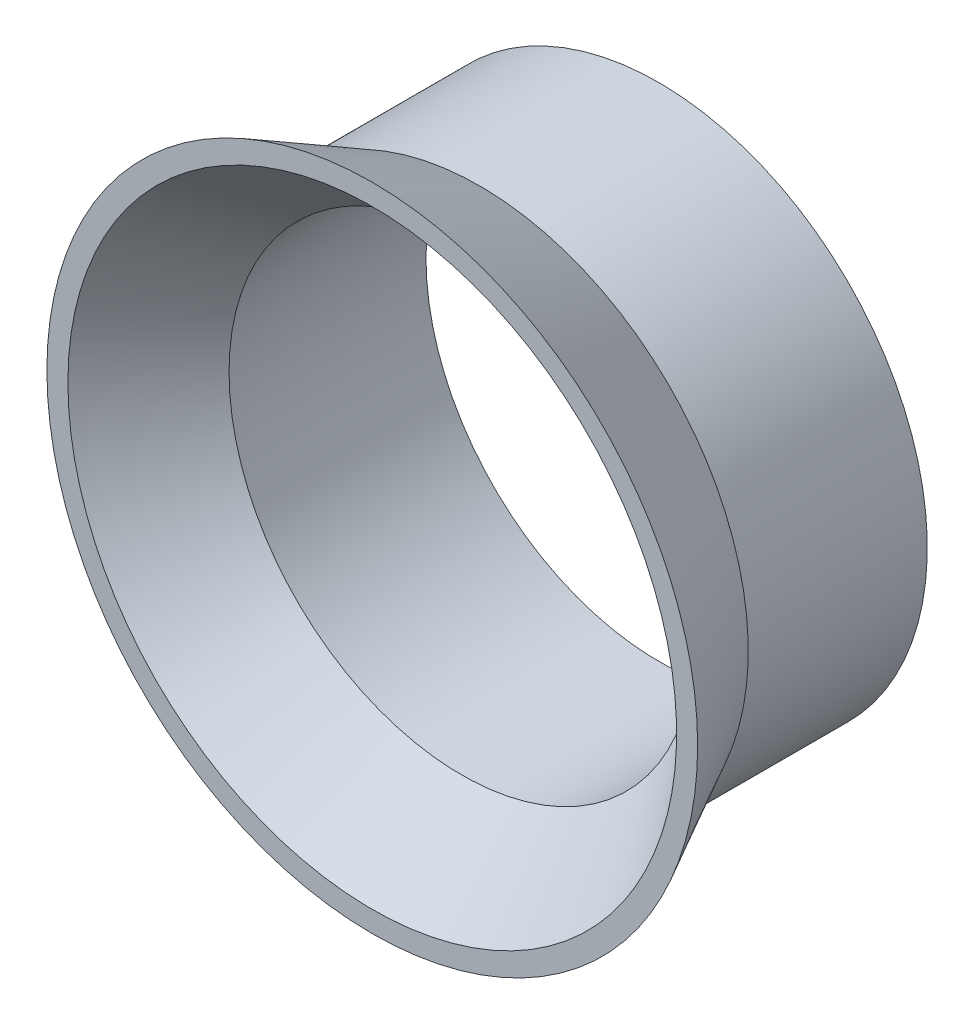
ISO-10303-21;
HEADER;
FILE_DESCRIPTION(('STEP AP214'),'2;1');
FILE_NAME('part.step','',(''),(''),'','','');
FILE_SCHEMA(('AUTOMOTIVE_DESIGN { 1 0 10303 214 1 1 1 1 }'));
ENDSEC;
DATA;
#1=APPLICATION_CONTEXT('core data for automotive mechanical design processes');
#2=APPLICATION_PROTOCOL_DEFINITION('international standard','automotive_design',2000,#1);
#3=PRODUCT_CONTEXT('',#1,'mechanical');
#4=PRODUCT('Part','Part','',(#3));
#5=PRODUCT_RELATED_PRODUCT_CATEGORY('part','',(#4));
#6=PRODUCT_DEFINITION_FORMATION('','',#4);
#7=PRODUCT_DEFINITION_CONTEXT('part definition',#1,'design');
#8=PRODUCT_DEFINITION('design','',#6,#7);
#9=PRODUCT_DEFINITION_SHAPE('','',#8);
#10=(LENGTH_UNIT() NAMED_UNIT(*) SI_UNIT(.MILLI.,.METRE.));
#11=(NAMED_UNIT(*) PLANE_ANGLE_UNIT() SI_UNIT($,.RADIAN.));
#12=(NAMED_UNIT(*) SI_UNIT($,.STERADIAN.) SOLID_ANGLE_UNIT());
#13=UNCERTAINTY_MEASURE_WITH_UNIT(LENGTH_MEASURE(1.E-05),#10,'distance_accuracy_value','');
#14=(GEOMETRIC_REPRESENTATION_CONTEXT(3) GLOBAL_UNCERTAINTY_ASSIGNED_CONTEXT((#13)) GLOBAL_UNIT_ASSIGNED_CONTEXT((#10,
#11,#12)) REPRESENTATION_CONTEXT('',''));
#15=CARTESIAN_POINT('',(0.,0.,0.));
#16=DIRECTION('',(0.,0.,1.));
#17=DIRECTION('',(1.,0.,0.));
#18=AXIS2_PLACEMENT_3D('',#15,#16,#17);
#19=CARTESIAN_POINT('',(0.,0.,0.));
#20=DIRECTION('',(0.,0.,1.));
#21=DIRECTION('',(1.,0.,0.));
#22=AXIS2_PLACEMENT_3D('',#19,#20,#21);
#23=PLANE('',#22);
#24=CARTESIAN_POINT('',(0.,0.,0.));
#25=DIRECTION('',(0.,0.,-1.));
#26=DIRECTION('',(-1.,0.,0.));
#27=AXIS2_PLACEMENT_3D('',#24,#25,#26);
#28=CIRCLE('',#27,26.);
#29=CARTESIAN_POINT('',(-26.,0.,0.));
#30=VERTEX_POINT('',#29);
#31=EDGE_CURVE('E51',#30,#30,#28,.T.);
#32=ORIENTED_EDGE('',*,*,#31,.F.);
#33=EDGE_LOOP('',(#32));
#34=FACE_BOUND('',#33,.T.);
#35=CARTESIAN_POINT('',(0.,0.,0.));
#36=DIRECTION('',(0.,0.,-1.));
#37=DIRECTION('',(-1.,0.,0.));
#38=AXIS2_PLACEMENT_3D('',#35,#36,#37);
#39=CIRCLE('',#38,30.);
#40=CARTESIAN_POINT('',(-30.,0.,0.));
#41=VERTEX_POINT('',#40);
#42=EDGE_CURVE('E11',#41,#41,#39,.T.);
#43=ORIENTED_EDGE('',*,*,#42,.T.);
#44=EDGE_LOOP('',(#43));
#45=FACE_BOUND('',#44,.T.);
#46=ADVANCED_FACE('F37',(#34,#45),#23,.F.);
#47=CARTESIAN_POINT('',(0.,0.,0.));
#48=DIRECTION('',(0.,0.,-1.));
#49=DIRECTION('',(-1.,0.,0.));
#50=AXIS2_PLACEMENT_3D('',#47,#48,#49);
#51=CYLINDRICAL_SURFACE('',#50,30.);
#52=CARTESIAN_POINT('',(0.,0.,20.));
#53=DIRECTION('',(0.,0.,-1.));
#54=DIRECTION('',(-1.,0.,0.));
#55=AXIS2_PLACEMENT_3D('',#52,#53,#54);
#56=CIRCLE('',#55,30.);
#57=CARTESIAN_POINT('',(-30.,0.,20.));
#58=VERTEX_POINT('',#57);
#59=EDGE_CURVE('E43',#58,#58,#56,.T.);
#60=ORIENTED_EDGE('',*,*,#59,.T.);
#61=EDGE_LOOP('',(#60));
#62=FACE_BOUND('',#61,.T.);
#63=ORIENTED_EDGE('',*,*,#42,.F.);
#64=EDGE_LOOP('',(#63));
#65=FACE_BOUND('',#64,.T.);
#66=ADVANCED_FACE('F77',(#62,#65),#51,.T.);
#67=CARTESIAN_POINT('',(0.,0.,20.));
#68=DIRECTION('',(0.,0.,1.));
#69=DIRECTION('',(1.,0.,0.));
#70=AXIS2_PLACEMENT_3D('',#67,#68,#69);
#71=CONICAL_SURFACE('',#70,30.,0.486498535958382);
#72=CARTESIAN_POINT('',(0.,0.,32.));
#73=DIRECTION('',(0.,0.,-1.));
#74=DIRECTION('',(-1.,0.,0.));
#75=AXIS2_PLACEMENT_3D('',#72,#73,#74);
#76=CIRCLE('',#75,36.3467864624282);
#77=CARTESIAN_POINT('',(-36.3467864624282,0.,32.));
#78=VERTEX_POINT('',#77);
#79=EDGE_CURVE('E47',#78,#78,#76,.T.);
#80=ORIENTED_EDGE('',*,*,#79,.T.);
#81=EDGE_LOOP('',(#80));
#82=FACE_BOUND('',#81,.T.);
#83=ORIENTED_EDGE('',*,*,#59,.F.);
#84=EDGE_LOOP('',(#83));
#85=FACE_BOUND('',#84,.T.);
#86=ADVANCED_FACE('F82',(#82,#85),#71,.T.);
#87=CARTESIAN_POINT('',(0.,0.,32.));
#88=DIRECTION('',(0.,0.,1.));
#89=DIRECTION('',(1.,0.,0.));
#90=AXIS2_PLACEMENT_3D('',#87,#88,#89);
#91=PLANE('',#90);
#92=CARTESIAN_POINT('',(0.,0.,32.));
#93=DIRECTION('',(0.,0.,-1.));
#94=DIRECTION('',(-1.,0.,0.));
#95=AXIS2_PLACEMENT_3D('',#92,#93,#94);
#96=CIRCLE('',#95,34.);
#97=CARTESIAN_POINT('',(-34.,0.,32.));
#98=VERTEX_POINT('',#97);
#99=EDGE_CURVE('E59',#98,#98,#96,.T.);
#100=ORIENTED_EDGE('',*,*,#99,.T.);
#101=EDGE_LOOP('',(#100));
#102=FACE_BOUND('',#101,.T.);
#103=ORIENTED_EDGE('',*,*,#79,.F.);
#104=EDGE_LOOP('',(#103));
#105=FACE_BOUND('',#104,.T.);
#106=ADVANCED_FACE('F63',(#102,#105),#91,.T.);
#107=CARTESIAN_POINT('',(0.,0.,0.));
#108=DIRECTION('',(0.,0.,-1.));
#109=DIRECTION('',(-1.,0.,0.));
#110=AXIS2_PLACEMENT_3D('',#107,#108,#109);
#111=CYLINDRICAL_SURFACE('',#110,26.);
#112=ORIENTED_EDGE('',*,*,#31,.T.);
#113=EDGE_LOOP('',(#112));
#114=FACE_BOUND('',#113,.T.);
#115=CARTESIAN_POINT('',(0.,0.,22.));
#116=DIRECTION('',(0.,0.,-1.));
#117=DIRECTION('',(-1.,0.,0.));
#118=AXIS2_PLACEMENT_3D('',#115,#116,#117);
#119=CIRCLE('',#118,26.);
#120=CARTESIAN_POINT('',(-26.,0.,22.));
#121=VERTEX_POINT('',#120);
#122=EDGE_CURVE('E56',#121,#121,#119,.T.);
#123=ORIENTED_EDGE('',*,*,#122,.F.);
#124=EDGE_LOOP('',(#123));
#125=FACE_BOUND('',#124,.T.);
#126=ADVANCED_FACE('F68',(#114,#125),#111,.F.);
#127=CARTESIAN_POINT('',(0.,0.,32.));
#128=DIRECTION('',(0.,0.,1.));
#129=DIRECTION('',(1.,0.,0.));
#130=AXIS2_PLACEMENT_3D('',#127,#128,#129);
#131=CONICAL_SURFACE('',#130,34.,0.674740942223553);
#132=ORIENTED_EDGE('',*,*,#122,.T.);
#133=EDGE_LOOP('',(#132));
#134=FACE_BOUND('',#133,.T.);
#135=ORIENTED_EDGE('',*,*,#99,.F.);
#136=EDGE_LOOP('',(#135));
#137=FACE_BOUND('',#136,.T.);
#138=ADVANCED_FACE('F66',(#134,#137),#131,.F.);
#139=CLOSED_SHELL('',(#46,#66,#86,#106,#126,#138));
#140=MANIFOLD_SOLID_BREP('B2',#139);
#141=ADVANCED_BREP_SHAPE_REPRESENTATION('',(#18,#140),#14);
#142=SHAPE_DEFINITION_REPRESENTATION(#9,#141);
ENDSEC;
END-ISO-10303-21;
